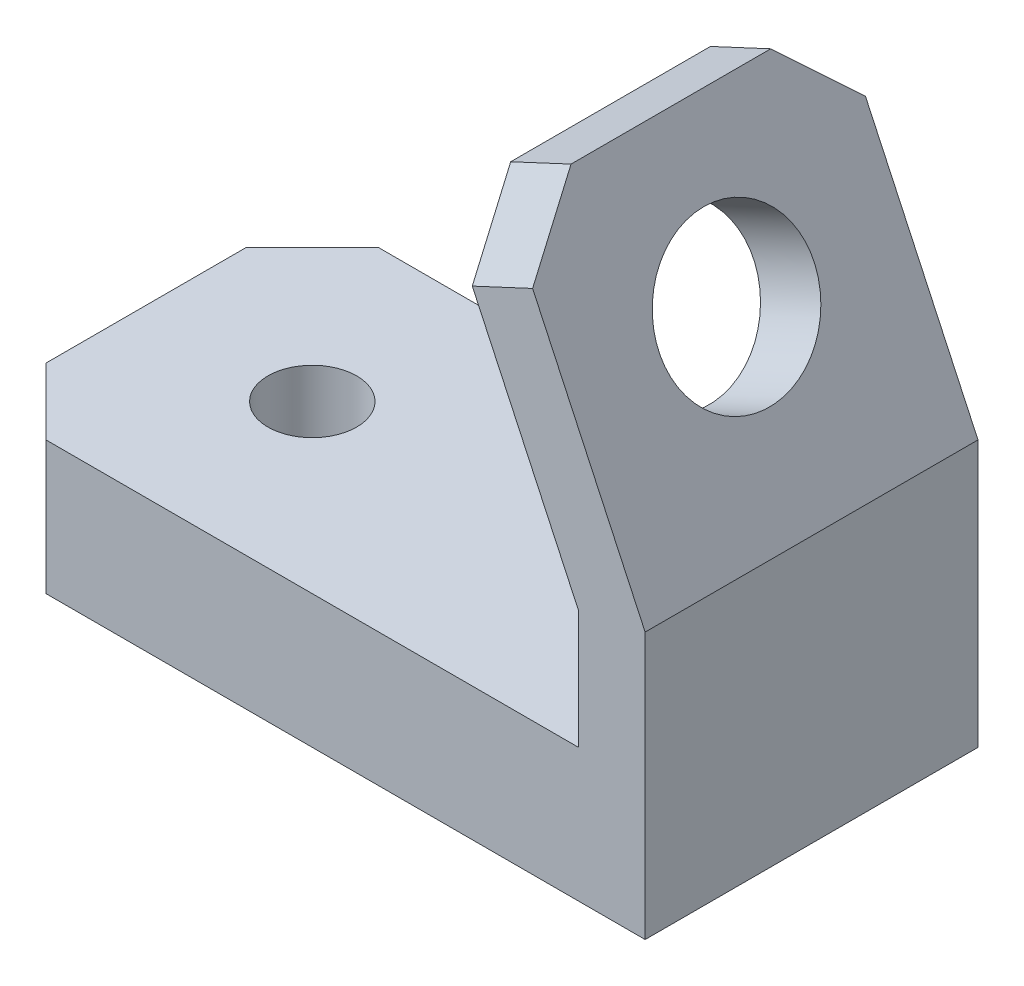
ISO-10303-21;
HEADER;
FILE_DESCRIPTION(('STEP AP214'),'2;1');
FILE_NAME('part.step','',(''),(''),'','','');
FILE_SCHEMA(('AUTOMOTIVE_DESIGN { 1 0 10303 214 1 1 1 1 }'));
ENDSEC;
DATA;
#1=APPLICATION_CONTEXT('core data for automotive mechanical design processes');
#2=APPLICATION_PROTOCOL_DEFINITION('international standard','automotive_design',2000,#1);
#3=PRODUCT_CONTEXT('',#1,'mechanical');
#4=PRODUCT('Part','Part','',(#3));
#5=PRODUCT_RELATED_PRODUCT_CATEGORY('part','',(#4));
#6=PRODUCT_DEFINITION_FORMATION('','',#4);
#7=PRODUCT_DEFINITION_CONTEXT('part definition',#1,'design');
#8=PRODUCT_DEFINITION('design','',#6,#7);
#9=PRODUCT_DEFINITION_SHAPE('','',#8);
#10=(LENGTH_UNIT() NAMED_UNIT(*) SI_UNIT(.MILLI.,.METRE.));
#11=(NAMED_UNIT(*) PLANE_ANGLE_UNIT() SI_UNIT($,.RADIAN.));
#12=(NAMED_UNIT(*) SI_UNIT($,.STERADIAN.) SOLID_ANGLE_UNIT());
#13=UNCERTAINTY_MEASURE_WITH_UNIT(LENGTH_MEASURE(1.E-05),#10,'distance_accuracy_value','');
#14=(GEOMETRIC_REPRESENTATION_CONTEXT(3) GLOBAL_UNCERTAINTY_ASSIGNED_CONTEXT((#13)) GLOBAL_UNIT_ASSIGNED_CONTEXT((#10,
#11,#12)) REPRESENTATION_CONTEXT('',''));
#15=CARTESIAN_POINT('',(0.,0.,0.));
#16=DIRECTION('',(0.,0.,1.));
#17=DIRECTION('',(1.,0.,0.));
#18=AXIS2_PLACEMENT_3D('',#15,#16,#17);
#19=CARTESIAN_POINT('',(0.,6.,7.5));
#20=DIRECTION('',(1.,0.,0.));
#21=DIRECTION('',(0.,1.,0.));
#22=AXIS2_PLACEMENT_3D('',#19,#20,#21);
#23=PLANE('',#22);
#24=DIRECTION('',(0.,0.,-1.));
#25=VECTOR('',#24,1.);
#26=CARTESIAN_POINT('',(0.,6.,7.5));
#27=LINE('',#26,#25);
#28=CARTESIAN_POINT('',(0.,6.,4.49999999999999));
#29=VERTEX_POINT('',#28);
#30=CARTESIAN_POINT('',(0.,6.,-4.49999999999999));
#31=VERTEX_POINT('',#30);
#32=EDGE_CURVE('E198',#29,#31,#27,.T.);
#33=ORIENTED_EDGE('',*,*,#32,.T.);
#34=DIRECTION('',(0.,-1.,0.));
#35=VECTOR('',#34,1.);
#36=CARTESIAN_POINT('',(0.,6.,-4.49999999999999));
#37=LINE('',#36,#35);
#38=CARTESIAN_POINT('',(0.,0.,-4.49999999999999));
#39=VERTEX_POINT('',#38);
#40=EDGE_CURVE('E260',#31,#39,#37,.T.);
#41=ORIENTED_EDGE('',*,*,#40,.T.);
#42=DIRECTION('',(0.,0.,-1.));
#43=VECTOR('',#42,1.);
#44=CARTESIAN_POINT('',(0.,0.,7.5));
#45=LINE('',#44,#43);
#46=CARTESIAN_POINT('',(0.,0.,4.49999999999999));
#47=VERTEX_POINT('',#46);
#48=EDGE_CURVE('E174',#47,#39,#45,.T.);
#49=ORIENTED_EDGE('',*,*,#48,.F.);
#50=DIRECTION('',(0.,1.,0.));
#51=VECTOR('',#50,1.);
#52=CARTESIAN_POINT('',(0.,6.,4.49999999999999));
#53=LINE('',#52,#51);
#54=EDGE_CURVE('E71',#47,#29,#53,.T.);
#55=ORIENTED_EDGE('',*,*,#54,.T.);
#56=EDGE_LOOP('',(#33,#41,#49,#55));
#57=FACE_BOUND('',#56,.T.);
#58=ADVANCED_FACE('F44',(#57),#23,.F.);
#59=CARTESIAN_POINT('',(0.,0.,7.5));
#60=DIRECTION('',(0.,1.,0.));
#61=DIRECTION('',(0.,0.,1.));
#62=AXIS2_PLACEMENT_3D('',#59,#60,#61);
#63=PLANE('',#62);
#64=CARTESIAN_POINT('',(22.5,0.,0.));
#65=DIRECTION('',(0.,-1.,0.));
#66=DIRECTION('',(0.,0.,-1.));
#67=AXIS2_PLACEMENT_3D('',#64,#65,#66);
#68=CIRCLE('',#67,2.);
#69=CARTESIAN_POINT('',(22.5,0.,-2.));
#70=VERTEX_POINT('',#69);
#71=EDGE_CURVE('E480',#70,#70,#68,.T.);
#72=ORIENTED_EDGE('',*,*,#71,.F.);
#73=EDGE_LOOP('',(#72));
#74=FACE_BOUND('',#73,.T.);
#75=CARTESIAN_POINT('',(7.5,0.,0.));
#76=DIRECTION('',(0.,-1.,0.));
#77=DIRECTION('',(0.,0.,-1.));
#78=AXIS2_PLACEMENT_3D('',#75,#76,#77);
#79=CIRCLE('',#78,2.);
#80=CARTESIAN_POINT('',(7.5,0.,-2.));
#81=VERTEX_POINT('',#80);
#82=EDGE_CURVE('E472',#81,#81,#79,.T.);
#83=ORIENTED_EDGE('',*,*,#82,.F.);
#84=EDGE_LOOP('',(#83));
#85=FACE_BOUND('',#84,.T.);
#86=ORIENTED_EDGE('',*,*,#48,.T.);
#87=DIRECTION('',(-0.707106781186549,0.,0.707106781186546));
#88=VECTOR('',#87,1.);
#89=CARTESIAN_POINT('',(0.,0.,-4.49999999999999));
#90=LINE('',#89,#88);
#91=CARTESIAN_POINT('',(3.00000000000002,0.,-7.5));
#92=VERTEX_POINT('',#91);
#93=EDGE_CURVE('E267',#39,#92,#90,.F.);
#94=ORIENTED_EDGE('',*,*,#93,.T.);
#95=DIRECTION('',(1.,0.,0.));
#96=VECTOR('',#95,1.);
#97=CARTESIAN_POINT('',(0.,0.,-7.5));
#98=LINE('',#97,#96);
#99=CARTESIAN_POINT('',(30.,0.,-7.5));
#100=VERTEX_POINT('',#99);
#101=EDGE_CURVE('E170',#92,#100,#98,.T.);
#102=ORIENTED_EDGE('',*,*,#101,.T.);
#103=DIRECTION('',(0.,0.,-1.));
#104=VECTOR('',#103,1.);
#105=CARTESIAN_POINT('',(30.,0.,7.5));
#106=LINE('',#105,#104);
#107=CARTESIAN_POINT('',(30.,0.,7.5));
#108=VERTEX_POINT('',#107);
#109=EDGE_CURVE('E166',#108,#100,#106,.T.);
#110=ORIENTED_EDGE('',*,*,#109,.F.);
#111=DIRECTION('',(1.,0.,0.));
#112=VECTOR('',#111,1.);
#113=CARTESIAN_POINT('',(0.,0.,7.5));
#114=LINE('',#113,#112);
#115=CARTESIAN_POINT('',(3.00000000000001,0.,7.5));
#116=VERTEX_POINT('',#115);
#117=EDGE_CURVE('E151',#116,#108,#114,.T.);
#118=ORIENTED_EDGE('',*,*,#117,.F.);
#119=DIRECTION('',(-0.707106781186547,0.,-0.707106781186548));
#120=VECTOR('',#119,1.);
#121=CARTESIAN_POINT('',(3.00000000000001,0.,7.5));
#122=LINE('',#121,#120);
#123=EDGE_CURVE('E264',#116,#47,#122,.T.);
#124=ORIENTED_EDGE('',*,*,#123,.T.);
#125=EDGE_LOOP('',(#86,#94,#102,#110,#118,#124));
#126=FACE_BOUND('',#125,.T.);
#127=ADVANCED_FACE('F168',(#74,#85,#126),#63,.F.);
#128=CARTESIAN_POINT('',(30.,0.,7.5));
#129=DIRECTION('',(-1.,0.,0.));
#130=DIRECTION('',(0.,0.,1.));
#131=AXIS2_PLACEMENT_3D('',#128,#129,#130);
#132=PLANE('',#131);
#133=DIRECTION('',(0.,1.,0.));
#134=VECTOR('',#133,1.);
#135=CARTESIAN_POINT('',(30.,0.,-7.5));
#136=LINE('',#135,#134);
#137=CARTESIAN_POINT('',(30.,12.,-7.5));
#138=VERTEX_POINT('',#137);
#139=EDGE_CURVE('E201',#100,#138,#136,.T.);
#140=ORIENTED_EDGE('',*,*,#139,.T.);
#141=DIRECTION('',(0.,0.,-1.));
#142=VECTOR('',#141,1.);
#143=CARTESIAN_POINT('',(30.,12.,7.5));
#144=LINE('',#143,#142);
#145=CARTESIAN_POINT('',(30.,12.,7.5));
#146=VERTEX_POINT('',#145);
#147=EDGE_CURVE('E175',#146,#138,#144,.T.);
#148=ORIENTED_EDGE('',*,*,#147,.F.);
#149=DIRECTION('',(0.,1.,0.));
#150=VECTOR('',#149,1.);
#151=CARTESIAN_POINT('',(30.,0.,7.5));
#152=LINE('',#151,#150);
#153=EDGE_CURVE('E156',#108,#146,#152,.T.);
#154=ORIENTED_EDGE('',*,*,#153,.F.);
#155=ORIENTED_EDGE('',*,*,#109,.T.);
#156=EDGE_LOOP('',(#140,#148,#154,#155));
#157=FACE_BOUND('',#156,.T.);
#158=ADVANCED_FACE('F177',(#157),#132,.F.);
#159=CARTESIAN_POINT('',(30.,12.,7.5));
#160=DIRECTION('',(-0.906307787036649,-0.422618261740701,0.));
#161=DIRECTION('',(0.422618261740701,-0.906307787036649,0.));
#162=AXIS2_PLACEMENT_3D('',#159,#160,#161);
#163=PLANE('',#162);
#164=CARTESIAN_POINT('',(26.6190539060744,19.2504622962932,0.));
#165=DIRECTION('',(0.906307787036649,0.422618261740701,0.));
#166=DIRECTION('',(-0.422618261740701,0.906307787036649,0.));
#167=AXIS2_PLACEMENT_3D('',#164,#165,#166);
#168=CIRCLE('',#167,3.5);
#169=CARTESIAN_POINT('',(25.1398899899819,22.4225395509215,0.));
#170=VERTEX_POINT('',#169);
#171=EDGE_CURVE('E490',#170,#170,#168,.T.);
#172=ORIENTED_EDGE('',*,*,#171,.F.);
#173=EDGE_LOOP('',(#172));
#174=FACE_BOUND('',#173,.T.);
#175=DIRECTION('',(-0.422618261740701,0.906307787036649,0.));
#176=VECTOR('',#175,1.);
#177=CARTESIAN_POINT('',(30.,12.,-7.5));
#178=LINE('',#177,#176);
#179=CARTESIAN_POINT('',(24.9285808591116,22.8756934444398,-7.5));
#180=VERTEX_POINT('',#179);
#181=EDGE_CURVE('E205',#138,#180,#178,.T.);
#182=ORIENTED_EDGE('',*,*,#181,.T.);
#183=DIRECTION('',(0.298836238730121,-0.640856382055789,-0.707106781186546));
#184=VECTOR('',#183,1.);
#185=CARTESIAN_POINT('',(23.6607260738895,25.5946168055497,-4.49999999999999));
#186=LINE('',#185,#184);
#187=CARTESIAN_POINT('',(23.6607260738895,25.5946168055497,-4.49999999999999));
#188=VERTEX_POINT('',#187);
#189=EDGE_CURVE('E251',#180,#188,#186,.F.);
#190=ORIENTED_EDGE('',*,*,#189,.T.);
#191=DIRECTION('',(0.,0.,-1.));
#192=VECTOR('',#191,1.);
#193=CARTESIAN_POINT('',(23.6607260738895,25.5946168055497,7.5));
#194=LINE('',#193,#192);
#195=CARTESIAN_POINT('',(23.6607260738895,25.5946168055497,4.49999999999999));
#196=VERTEX_POINT('',#195);
#197=EDGE_CURVE('E228',#196,#188,#194,.T.);
#198=ORIENTED_EDGE('',*,*,#197,.F.);
#199=DIRECTION('',(0.29883623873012,-0.640856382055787,0.707106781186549));
#200=VECTOR('',#199,1.);
#201=CARTESIAN_POINT('',(24.9285808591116,22.8756934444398,7.50000000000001));
#202=LINE('',#201,#200);
#203=CARTESIAN_POINT('',(24.9285808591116,22.8756934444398,7.5));
#204=VERTEX_POINT('',#203);
#205=EDGE_CURVE('E249',#196,#204,#202,.T.);
#206=ORIENTED_EDGE('',*,*,#205,.T.);
#207=DIRECTION('',(-0.422618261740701,0.906307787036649,0.));
#208=VECTOR('',#207,1.);
#209=CARTESIAN_POINT('',(30.,12.,7.5));
#210=LINE('',#209,#208);
#211=EDGE_CURVE('E181',#146,#204,#210,.T.);
#212=ORIENTED_EDGE('',*,*,#211,.F.);
#213=ORIENTED_EDGE('',*,*,#147,.T.);
#214=EDGE_LOOP('',(#182,#190,#198,#206,#212,#213));
#215=FACE_BOUND('',#214,.T.);
#216=ADVANCED_FACE('F286',(#174,#215),#163,.F.);
#217=CARTESIAN_POINT('',(23.6607260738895,25.5946168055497,7.5));
#218=DIRECTION('',(0.422618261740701,-0.906307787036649,0.));
#219=DIRECTION('',(0.906307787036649,0.422618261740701,0.));
#220=AXIS2_PLACEMENT_3D('',#217,#218,#219);
#221=PLANE('',#220);
#222=ORIENTED_EDGE('',*,*,#197,.T.);
#223=DIRECTION('',(-0.906307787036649,-0.422618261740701,0.));
#224=VECTOR('',#223,1.);
#225=CARTESIAN_POINT('',(23.6607260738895,25.5946168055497,-4.49999999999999));
#226=LINE('',#225,#224);
#227=CARTESIAN_POINT('',(20.9418027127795,24.3267620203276,-4.49999999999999));
#228=VERTEX_POINT('',#227);
#229=EDGE_CURVE('E237',#188,#228,#226,.T.);
#230=ORIENTED_EDGE('',*,*,#229,.T.);
#231=DIRECTION('',(0.,0.,-1.));
#232=VECTOR('',#231,1.);
#233=CARTESIAN_POINT('',(20.9418027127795,24.3267620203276,7.5));
#234=LINE('',#233,#232);
#235=CARTESIAN_POINT('',(20.9418027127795,24.3267620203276,4.49999999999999));
#236=VERTEX_POINT('',#235);
#237=EDGE_CURVE('E225',#236,#228,#234,.T.);
#238=ORIENTED_EDGE('',*,*,#237,.F.);
#239=DIRECTION('',(0.906307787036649,0.422618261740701,0.));
#240=VECTOR('',#239,1.);
#241=CARTESIAN_POINT('',(23.6607260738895,25.5946168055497,4.49999999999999));
#242=LINE('',#241,#240);
#243=EDGE_CURVE('E235',#236,#196,#242,.T.);
#244=ORIENTED_EDGE('',*,*,#243,.T.);
#245=EDGE_LOOP('',(#222,#230,#238,#244));
#246=FACE_BOUND('',#245,.T.);
#247=ADVANCED_FACE('F300',(#246),#221,.F.);
#248=CARTESIAN_POINT('',(20.9418027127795,24.3267620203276,7.5));
#249=DIRECTION('',(0.906307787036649,0.422618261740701,0.));
#250=DIRECTION('',(-0.422618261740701,0.906307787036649,0.));
#251=AXIS2_PLACEMENT_3D('',#248,#249,#250);
#252=PLANE('',#251);
#253=CARTESIAN_POINT('',(23.9001305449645,17.9826075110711,0.));
#254=DIRECTION('',(0.906307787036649,0.422618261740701,0.));
#255=DIRECTION('',(-0.422618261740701,0.906307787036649,0.));
#256=AXIS2_PLACEMENT_3D('',#253,#254,#255);
#257=CIRCLE('',#256,3.5);
#258=CARTESIAN_POINT('',(22.420966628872,21.1546847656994,0.));
#259=VERTEX_POINT('',#258);
#260=EDGE_CURVE('E486',#259,#259,#257,.T.);
#261=ORIENTED_EDGE('',*,*,#260,.T.);
#262=EDGE_LOOP('',(#261));
#263=FACE_BOUND('',#262,.T.);
#264=ORIENTED_EDGE('',*,*,#237,.T.);
#265=DIRECTION('',(-0.298836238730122,0.640856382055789,0.707106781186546));
#266=VECTOR('',#265,1.);
#267=CARTESIAN_POINT('',(20.9418027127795,24.3267620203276,-4.49999999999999));
#268=LINE('',#267,#266);
#269=CARTESIAN_POINT('',(22.2096574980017,21.6078386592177,-7.5));
#270=VERTEX_POINT('',#269);
#271=EDGE_CURVE('E242',#228,#270,#268,.F.);
#272=ORIENTED_EDGE('',*,*,#271,.T.);
#273=DIRECTION('',(0.422618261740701,-0.906307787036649,0.));
#274=VECTOR('',#273,1.);
#275=CARTESIAN_POINT('',(20.9418027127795,24.3267620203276,-7.5));
#276=LINE('',#275,#274);
#277=CARTESIAN_POINT('',(27.,11.3349160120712,-7.5));
#278=VERTEX_POINT('',#277);
#279=EDGE_CURVE('E209',#270,#278,#276,.T.);
#280=ORIENTED_EDGE('',*,*,#279,.T.);
#281=DIRECTION('',(0.,0.,-1.));
#282=VECTOR('',#281,1.);
#283=CARTESIAN_POINT('',(27.,11.3349160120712,7.5));
#284=LINE('',#283,#282);
#285=CARTESIAN_POINT('',(27.,11.3349160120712,7.5));
#286=VERTEX_POINT('',#285);
#287=EDGE_CURVE('E222',#286,#278,#284,.T.);
#288=ORIENTED_EDGE('',*,*,#287,.F.);
#289=DIRECTION('',(0.422618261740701,-0.906307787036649,0.));
#290=VECTOR('',#289,1.);
#291=CARTESIAN_POINT('',(20.9418027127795,24.3267620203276,7.5));
#292=LINE('',#291,#290);
#293=CARTESIAN_POINT('',(22.2096574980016,21.6078386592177,7.5));
#294=VERTEX_POINT('',#293);
#295=EDGE_CURVE('E186',#294,#286,#292,.T.);
#296=ORIENTED_EDGE('',*,*,#295,.F.);
#297=DIRECTION('',(-0.29883623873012,0.640856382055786,-0.707106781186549));
#298=VECTOR('',#297,1.);
#299=CARTESIAN_POINT('',(22.2096574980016,21.6078386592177,7.5));
#300=LINE('',#299,#298);
#301=EDGE_CURVE('E240',#294,#236,#300,.T.);
#302=ORIENTED_EDGE('',*,*,#301,.T.);
#303=EDGE_LOOP('',(#264,#272,#280,#288,#296,#302));
#304=FACE_BOUND('',#303,.T.);
#305=ADVANCED_FACE('F297',(#263,#304),#252,.F.);
#306=CARTESIAN_POINT('',(27.,11.3349160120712,7.5));
#307=DIRECTION('',(1.,0.,0.));
#308=DIRECTION('',(0.,0.,-1.));
#309=AXIS2_PLACEMENT_3D('',#306,#307,#308);
#310=PLANE('',#309);
#311=DIRECTION('',(0.,-1.,0.));
#312=VECTOR('',#311,1.);
#313=CARTESIAN_POINT('',(27.,11.3349160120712,-7.5));
#314=LINE('',#313,#312);
#315=CARTESIAN_POINT('',(27.,6.,-7.5));
#316=VERTEX_POINT('',#315);
#317=EDGE_CURVE('E212',#278,#316,#314,.T.);
#318=ORIENTED_EDGE('',*,*,#317,.T.);
#319=DIRECTION('',(0.,0.,-1.));
#320=VECTOR('',#319,1.);
#321=CARTESIAN_POINT('',(27.,6.,7.5));
#322=LINE('',#321,#320);
#323=CARTESIAN_POINT('',(27.,6.,7.5));
#324=VERTEX_POINT('',#323);
#325=EDGE_CURVE('E219',#324,#316,#322,.T.);
#326=ORIENTED_EDGE('',*,*,#325,.F.);
#327=DIRECTION('',(0.,-1.,0.));
#328=VECTOR('',#327,1.);
#329=CARTESIAN_POINT('',(27.,11.3349160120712,7.5));
#330=LINE('',#329,#328);
#331=EDGE_CURVE('E192',#286,#324,#330,.T.);
#332=ORIENTED_EDGE('',*,*,#331,.F.);
#333=ORIENTED_EDGE('',*,*,#287,.T.);
#334=EDGE_LOOP('',(#318,#326,#332,#333));
#335=FACE_BOUND('',#334,.T.);
#336=ADVANCED_FACE('F307',(#335),#310,.F.);
#337=CARTESIAN_POINT('',(27.,6.,7.5));
#338=DIRECTION('',(0.,-1.,0.));
#339=DIRECTION('',(1.,0.,0.));
#340=AXIS2_PLACEMENT_3D('',#337,#338,#339);
#341=PLANE('',#340);
#342=CARTESIAN_POINT('',(22.5,6.,0.));
#343=DIRECTION('',(0.,-1.,0.));
#344=DIRECTION('',(1.,0.,0.));
#345=AXIS2_PLACEMENT_3D('',#342,#343,#344);
#346=CIRCLE('',#345,2.);
#347=CARTESIAN_POINT('',(24.5,6.,0.));
#348=VERTEX_POINT('',#347);
#349=EDGE_CURVE('E475',#348,#348,#346,.T.);
#350=ORIENTED_EDGE('',*,*,#349,.T.);
#351=EDGE_LOOP('',(#350));
#352=FACE_BOUND('',#351,.T.);
#353=CARTESIAN_POINT('',(7.5,6.,0.));
#354=DIRECTION('',(0.,-1.,0.));
#355=DIRECTION('',(1.,0.,0.));
#356=AXIS2_PLACEMENT_3D('',#353,#354,#355);
#357=CIRCLE('',#356,2.);
#358=CARTESIAN_POINT('',(9.5,6.,0.));
#359=VERTEX_POINT('',#358);
#360=EDGE_CURVE('E202',#359,#359,#357,.T.);
#361=ORIENTED_EDGE('',*,*,#360,.T.);
#362=EDGE_LOOP('',(#361));
#363=FACE_BOUND('',#362,.T.);
#364=DIRECTION('',(-1.,0.,0.));
#365=VECTOR('',#364,1.);
#366=CARTESIAN_POINT('',(27.,6.,-7.5));
#367=LINE('',#366,#365);
#368=CARTESIAN_POINT('',(3.00000000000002,6.,-7.5));
#369=VERTEX_POINT('',#368);
#370=EDGE_CURVE('E163',#316,#369,#367,.T.);
#371=ORIENTED_EDGE('',*,*,#370,.T.);
#372=DIRECTION('',(0.707106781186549,0.,-0.707106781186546));
#373=VECTOR('',#372,1.);
#374=CARTESIAN_POINT('',(0.,6.,-4.49999999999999));
#375=LINE('',#374,#373);
#376=EDGE_CURVE('E11',#369,#31,#375,.F.);
#377=ORIENTED_EDGE('',*,*,#376,.T.);
#378=ORIENTED_EDGE('',*,*,#32,.F.);
#379=DIRECTION('',(0.707106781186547,0.,0.707106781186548));
#380=VECTOR('',#379,1.);
#381=CARTESIAN_POINT('',(3.00000000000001,6.,7.5));
#382=LINE('',#381,#380);
#383=CARTESIAN_POINT('',(3.00000000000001,6.,7.5));
#384=VERTEX_POINT('',#383);
#385=EDGE_CURVE('E54',#29,#384,#382,.T.);
#386=ORIENTED_EDGE('',*,*,#385,.T.);
#387=DIRECTION('',(-1.,0.,0.));
#388=VECTOR('',#387,1.);
#389=CARTESIAN_POINT('',(27.,6.,7.5));
#390=LINE('',#389,#388);
#391=EDGE_CURVE('E195',#324,#384,#390,.T.);
#392=ORIENTED_EDGE('',*,*,#391,.F.);
#393=ORIENTED_EDGE('',*,*,#325,.T.);
#394=EDGE_LOOP('',(#371,#377,#378,#386,#392,#393));
#395=FACE_BOUND('',#394,.T.);
#396=ADVANCED_FACE('F272',(#352,#363,#395),#341,.F.);
#397=CARTESIAN_POINT('',(0.,0.,7.5));
#398=DIRECTION('',(0.,0.,1.));
#399=DIRECTION('',(1.,0.,0.));
#400=AXIS2_PLACEMENT_3D('',#397,#398,#399);
#401=PLANE('',#400);
#402=ORIENTED_EDGE('',*,*,#211,.T.);
#403=DIRECTION('',(-0.906307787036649,-0.422618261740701,0.));
#404=VECTOR('',#403,1.);
#405=CARTESIAN_POINT('',(22.2096574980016,21.6078386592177,7.5));
#406=LINE('',#405,#404);
#407=EDGE_CURVE('E255',#204,#294,#406,.T.);
#408=ORIENTED_EDGE('',*,*,#407,.T.);
#409=ORIENTED_EDGE('',*,*,#295,.T.);
#410=ORIENTED_EDGE('',*,*,#331,.T.);
#411=ORIENTED_EDGE('',*,*,#391,.T.);
#412=DIRECTION('',(0.,-1.,0.));
#413=VECTOR('',#412,1.);
#414=CARTESIAN_POINT('',(3.00000000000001,0.,7.5));
#415=LINE('',#414,#413);
#416=EDGE_CURVE('E160',#384,#116,#415,.T.);
#417=ORIENTED_EDGE('',*,*,#416,.T.);
#418=ORIENTED_EDGE('',*,*,#117,.T.);
#419=ORIENTED_EDGE('',*,*,#153,.T.);
#420=EDGE_LOOP('',(#402,#408,#409,#410,#411,#417,#418,#419));
#421=FACE_BOUND('',#420,.T.);
#422=ADVANCED_FACE('F154',(#421),#401,.T.);
#423=CARTESIAN_POINT('',(0.,0.,-7.5));
#424=DIRECTION('',(0.,0.,1.));
#425=DIRECTION('',(1.,0.,0.));
#426=AXIS2_PLACEMENT_3D('',#423,#424,#425);
#427=PLANE('',#426);
#428=ORIENTED_EDGE('',*,*,#279,.F.);
#429=DIRECTION('',(0.906307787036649,0.422618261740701,0.));
#430=VECTOR('',#429,1.);
#431=CARTESIAN_POINT('',(-4.30949994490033,9.24175245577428,-7.5));
#432=LINE('',#431,#430);
#433=EDGE_CURVE('E247',#270,#180,#432,.T.);
#434=ORIENTED_EDGE('',*,*,#433,.T.);
#435=ORIENTED_EDGE('',*,*,#181,.F.);
#436=ORIENTED_EDGE('',*,*,#139,.F.);
#437=ORIENTED_EDGE('',*,*,#101,.F.);
#438=DIRECTION('',(0.,1.,0.));
#439=VECTOR('',#438,1.);
#440=CARTESIAN_POINT('',(3.00000000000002,0.,-7.5));
#441=LINE('',#440,#439);
#442=EDGE_CURVE('E244',#92,#369,#441,.T.);
#443=ORIENTED_EDGE('',*,*,#442,.T.);
#444=ORIENTED_EDGE('',*,*,#370,.F.);
#445=ORIENTED_EDGE('',*,*,#317,.F.);
#446=EDGE_LOOP('',(#428,#434,#435,#436,#437,#443,#444,#445));
#447=FACE_BOUND('',#446,.T.);
#448=ADVANCED_FACE('F282',(#447),#427,.F.);
#449=CARTESIAN_POINT('',(7.5,0.,0.));
#450=DIRECTION('',(0.,-1.,0.));
#451=DIRECTION('',(0.,0.,-1.));
#452=AXIS2_PLACEMENT_3D('',#449,#450,#451);
#453=CYLINDRICAL_SURFACE('',#452,2.);
#454=ORIENTED_EDGE('',*,*,#360,.F.);
#455=EDGE_LOOP('',(#454));
#456=FACE_BOUND('',#455,.T.);
#457=ORIENTED_EDGE('',*,*,#82,.T.);
#458=EDGE_LOOP('',(#457));
#459=FACE_BOUND('',#458,.T.);
#460=ADVANCED_FACE('F373',(#456,#459),#453,.F.);
#461=CARTESIAN_POINT('',(22.5,0.,0.));
#462=DIRECTION('',(0.,-1.,0.));
#463=DIRECTION('',(0.,0.,-1.));
#464=AXIS2_PLACEMENT_3D('',#461,#462,#463);
#465=CYLINDRICAL_SURFACE('',#464,2.);
#466=ORIENTED_EDGE('',*,*,#349,.F.);
#467=EDGE_LOOP('',(#466));
#468=FACE_BOUND('',#467,.T.);
#469=ORIENTED_EDGE('',*,*,#71,.T.);
#470=EDGE_LOOP('',(#469));
#471=FACE_BOUND('',#470,.T.);
#472=ADVANCED_FACE('F433',(#468,#471),#465,.F.);
#473=CARTESIAN_POINT('',(26.6190539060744,19.2504622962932,0.));
#474=DIRECTION('',(0.906307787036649,0.422618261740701,0.));
#475=DIRECTION('',(-0.422618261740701,0.906307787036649,0.));
#476=AXIS2_PLACEMENT_3D('',#473,#474,#475);
#477=CYLINDRICAL_SURFACE('',#476,3.5);
#478=ORIENTED_EDGE('',*,*,#260,.F.);
#479=EDGE_LOOP('',(#478));
#480=FACE_BOUND('',#479,.T.);
#481=ORIENTED_EDGE('',*,*,#171,.T.);
#482=EDGE_LOOP('',(#481));
#483=FACE_BOUND('',#482,.T.);
#484=ADVANCED_FACE('F333',(#480,#483),#477,.F.);
#485=CARTESIAN_POINT('',(23.6607260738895,25.5946168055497,-4.49999999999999));
#486=DIRECTION('',(0.298836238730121,-0.640856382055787,0.707106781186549));
#487=DIRECTION('',(-0.906307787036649,-0.422618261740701,0.));
#488=AXIS2_PLACEMENT_3D('',#485,#486,#487);
#489=PLANE('',#488);
#490=ORIENTED_EDGE('',*,*,#189,.F.);
#491=ORIENTED_EDGE('',*,*,#433,.F.);
#492=ORIENTED_EDGE('',*,*,#271,.F.);
#493=ORIENTED_EDGE('',*,*,#229,.F.);
#494=EDGE_LOOP('',(#490,#491,#492,#493));
#495=FACE_BOUND('',#494,.T.);
#496=ADVANCED_FACE('F303',(#495),#489,.F.);
#497=CARTESIAN_POINT('',(-4.30949994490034,9.2417524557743,7.5));
#498=DIRECTION('',(-0.298836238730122,0.640856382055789,0.707106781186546));
#499=DIRECTION('',(0.906307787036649,0.422618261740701,0.));
#500=AXIS2_PLACEMENT_3D('',#497,#498,#499);
#501=PLANE('',#500);
#502=ORIENTED_EDGE('',*,*,#205,.F.);
#503=ORIENTED_EDGE('',*,*,#243,.F.);
#504=ORIENTED_EDGE('',*,*,#301,.F.);
#505=ORIENTED_EDGE('',*,*,#407,.F.);
#506=EDGE_LOOP('',(#502,#503,#504,#505));
#507=FACE_BOUND('',#506,.T.);
#508=ADVANCED_FACE('F293',(#507),#501,.T.);
#509=CARTESIAN_POINT('',(0.,6.,-4.49999999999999));
#510=DIRECTION('',(0.707106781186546,0.,0.707106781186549));
#511=DIRECTION('',(0.,-1.,0.));
#512=AXIS2_PLACEMENT_3D('',#509,#510,#511);
#513=PLANE('',#512);
#514=ORIENTED_EDGE('',*,*,#376,.F.);
#515=ORIENTED_EDGE('',*,*,#442,.F.);
#516=ORIENTED_EDGE('',*,*,#93,.F.);
#517=ORIENTED_EDGE('',*,*,#40,.F.);
#518=EDGE_LOOP('',(#514,#515,#516,#517));
#519=FACE_BOUND('',#518,.T.);
#520=ADVANCED_FACE('F278',(#519),#513,.F.);
#521=CARTESIAN_POINT('',(3.00000000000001,0.,7.5));
#522=DIRECTION('',(-0.707106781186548,0.,0.707106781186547));
#523=DIRECTION('',(0.,1.,0.));
#524=AXIS2_PLACEMENT_3D('',#521,#522,#523);
#525=PLANE('',#524);
#526=ORIENTED_EDGE('',*,*,#385,.F.);
#527=ORIENTED_EDGE('',*,*,#54,.F.);
#528=ORIENTED_EDGE('',*,*,#123,.F.);
#529=ORIENTED_EDGE('',*,*,#416,.F.);
#530=EDGE_LOOP('',(#526,#527,#528,#529));
#531=FACE_BOUND('',#530,.T.);
#532=ADVANCED_FACE('F47',(#531),#525,.T.);
#533=CLOSED_SHELL('',(#58,#127,#158,#216,#247,#305,#336,#396,#422,#448,#460,#472,#484,#496,#508,
#520,#532));
#534=MANIFOLD_SOLID_BREP('B2',#533);
#535=ADVANCED_BREP_SHAPE_REPRESENTATION('',(#18,#534),#14);
#536=SHAPE_DEFINITION_REPRESENTATION(#9,#535);
ENDSEC;
END-ISO-10303-21;
